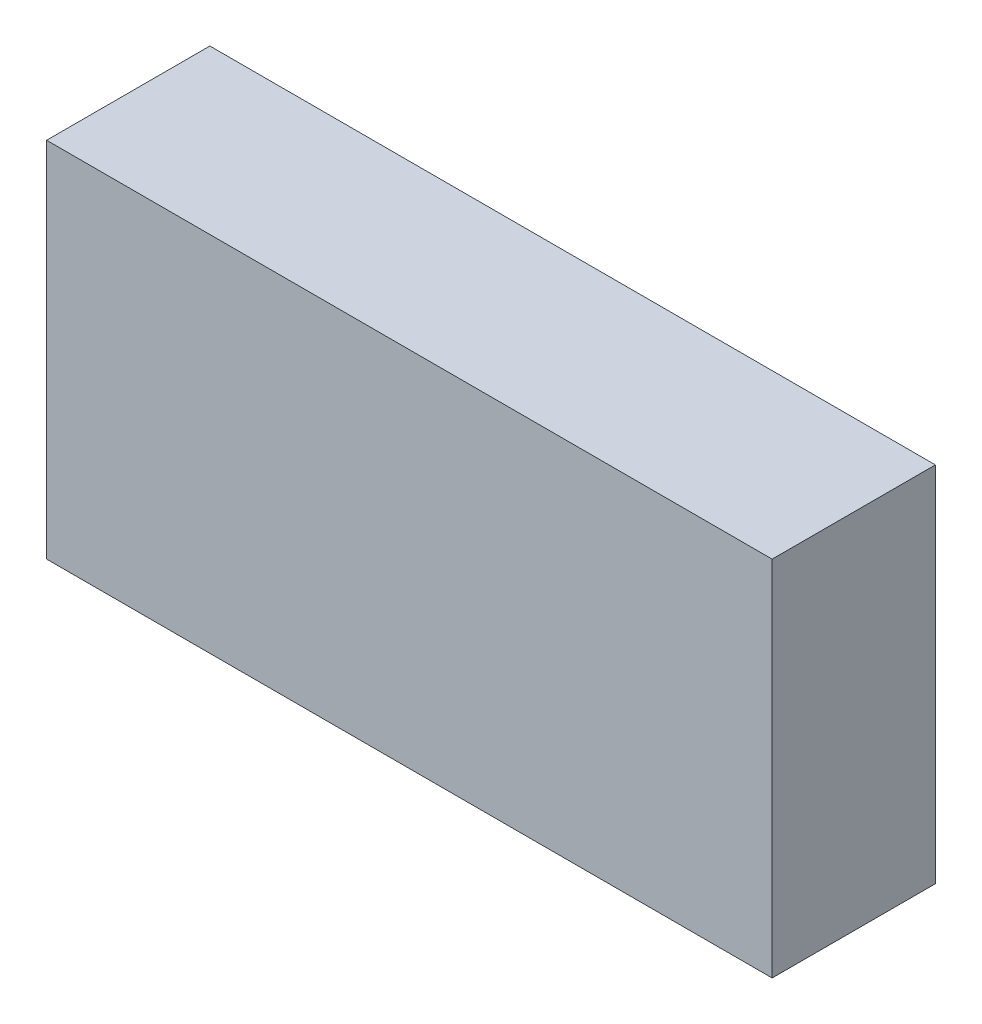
ISO-10303-21;
HEADER;
FILE_DESCRIPTION(('STEP AP214'),'2;1');
FILE_NAME('part.step','',(''),(''),'','','');
FILE_SCHEMA(('AUTOMOTIVE_DESIGN { 1 0 10303 214 1 1 1 1 }'));
ENDSEC;
DATA;
#1=APPLICATION_CONTEXT('core data for automotive mechanical design processes');
#2=APPLICATION_PROTOCOL_DEFINITION('international standard','automotive_design',2000,#1);
#3=PRODUCT_CONTEXT('',#1,'mechanical');
#4=PRODUCT('Part','Part','',(#3));
#5=PRODUCT_RELATED_PRODUCT_CATEGORY('part','',(#4));
#6=PRODUCT_DEFINITION_FORMATION('','',#4);
#7=PRODUCT_DEFINITION_CONTEXT('part definition',#1,'design');
#8=PRODUCT_DEFINITION('design','',#6,#7);
#9=PRODUCT_DEFINITION_SHAPE('','',#8);
#10=(LENGTH_UNIT() NAMED_UNIT(*) SI_UNIT(.MILLI.,.METRE.));
#11=(NAMED_UNIT(*) PLANE_ANGLE_UNIT() SI_UNIT($,.RADIAN.));
#12=(NAMED_UNIT(*) SI_UNIT($,.STERADIAN.) SOLID_ANGLE_UNIT());
#13=UNCERTAINTY_MEASURE_WITH_UNIT(LENGTH_MEASURE(1.E-05),#10,'distance_accuracy_value','');
#14=(GEOMETRIC_REPRESENTATION_CONTEXT(3) GLOBAL_UNCERTAINTY_ASSIGNED_CONTEXT((#13)) GLOBAL_UNIT_ASSIGNED_CONTEXT((#10,
#11,#12)) REPRESENTATION_CONTEXT('',''));
#15=CARTESIAN_POINT('',(0.,0.,0.));
#16=DIRECTION('',(0.,0.,1.));
#17=DIRECTION('',(1.,0.,0.));
#18=AXIS2_PLACEMENT_3D('',#15,#16,#17);
#19=CARTESIAN_POINT('',(0.,0.,27.));
#20=DIRECTION('',(1.,0.,0.));
#21=DIRECTION('',(0.,1.,0.));
#22=AXIS2_PLACEMENT_3D('',#19,#20,#21);
#23=PLANE('',#22);
#24=DIRECTION('',(0.,-1.,0.));
#25=VECTOR('',#24,1.);
#26=CARTESIAN_POINT('',(0.,0.,0.));
#27=LINE('',#26,#25);
#28=CARTESIAN_POINT('',(0.,0.,0.));
#29=VERTEX_POINT('',#28);
#30=CARTESIAN_POINT('',(0.,-60.,0.));
#31=VERTEX_POINT('',#30);
#32=EDGE_CURVE('E392',#29,#31,#27,.T.);
#33=ORIENTED_EDGE('',*,*,#32,.T.);
#34=DIRECTION('',(0.,0.,-1.));
#35=VECTOR('',#34,1.);
#36=CARTESIAN_POINT('',(0.,-60.,27.));
#37=LINE('',#36,#35);
#38=CARTESIAN_POINT('',(0.,-60.,27.));
#39=VERTEX_POINT('',#38);
#40=EDGE_CURVE('E11',#39,#31,#37,.T.);
#41=ORIENTED_EDGE('',*,*,#40,.F.);
#42=DIRECTION('',(0.,-1.,0.));
#43=VECTOR('',#42,1.);
#44=CARTESIAN_POINT('',(0.,0.,27.));
#45=LINE('',#44,#43);
#46=CARTESIAN_POINT('',(0.,0.,27.));
#47=VERTEX_POINT('',#46);
#48=EDGE_CURVE('E410',#47,#39,#45,.T.);
#49=ORIENTED_EDGE('',*,*,#48,.F.);
#50=DIRECTION('',(0.,0.,-1.));
#51=VECTOR('',#50,1.);
#52=CARTESIAN_POINT('',(0.,0.,27.));
#53=LINE('',#52,#51);
#54=EDGE_CURVE('E404',#47,#29,#53,.T.);
#55=ORIENTED_EDGE('',*,*,#54,.T.);
#56=EDGE_LOOP('',(#33,#41,#49,#55));
#57=FACE_BOUND('',#56,.T.);
#58=ADVANCED_FACE('F348',(#57),#23,.F.);
#59=CARTESIAN_POINT('',(0.,-60.,27.));
#60=DIRECTION('',(0.,1.,0.));
#61=DIRECTION('',(0.,0.,1.));
#62=AXIS2_PLACEMENT_3D('',#59,#60,#61);
#63=PLANE('',#62);
#64=DIRECTION('',(1.,0.,0.));
#65=VECTOR('',#64,1.);
#66=CARTESIAN_POINT('',(0.,-60.,0.));
#67=LINE('',#66,#65);
#68=CARTESIAN_POINT('',(120.,-60.,0.));
#69=VERTEX_POINT('',#68);
#70=EDGE_CURVE('E388',#31,#69,#67,.T.);
#71=ORIENTED_EDGE('',*,*,#70,.T.);
#72=DIRECTION('',(0.,0.,-1.));
#73=VECTOR('',#72,1.);
#74=CARTESIAN_POINT('',(120.,-60.,27.));
#75=LINE('',#74,#73);
#76=CARTESIAN_POINT('',(120.,-60.,27.));
#77=VERTEX_POINT('',#76);
#78=EDGE_CURVE('E355',#77,#69,#75,.T.);
#79=ORIENTED_EDGE('',*,*,#78,.F.);
#80=DIRECTION('',(1.,0.,0.));
#81=VECTOR('',#80,1.);
#82=CARTESIAN_POINT('',(0.,-60.,27.));
#83=LINE('',#82,#81);
#84=EDGE_CURVE('E400',#39,#77,#83,.T.);
#85=ORIENTED_EDGE('',*,*,#84,.F.);
#86=ORIENTED_EDGE('',*,*,#40,.T.);
#87=EDGE_LOOP('',(#71,#79,#85,#86));
#88=FACE_BOUND('',#87,.T.);
#89=ADVANCED_FACE('F399',(#88),#63,.F.);
#90=CARTESIAN_POINT('',(120.,0.,27.));
#91=DIRECTION('',(-1.,0.,0.));
#92=DIRECTION('',(0.,-1.,0.));
#93=AXIS2_PLACEMENT_3D('',#90,#91,#92);
#94=PLANE('',#93);
#95=DIRECTION('',(0.,1.,0.));
#96=VECTOR('',#95,1.);
#97=CARTESIAN_POINT('',(120.,0.,0.));
#98=LINE('',#97,#96);
#99=CARTESIAN_POINT('',(120.,0.,0.));
#100=VERTEX_POINT('',#99);
#101=EDGE_CURVE('E393',#69,#100,#98,.T.);
#102=ORIENTED_EDGE('',*,*,#101,.T.);
#103=DIRECTION('',(0.,0.,-1.));
#104=VECTOR('',#103,1.);
#105=CARTESIAN_POINT('',(120.,0.,27.));
#106=LINE('',#105,#104);
#107=CARTESIAN_POINT('',(120.,0.,27.));
#108=VERTEX_POINT('',#107);
#109=EDGE_CURVE('E416',#108,#100,#106,.T.);
#110=ORIENTED_EDGE('',*,*,#109,.F.);
#111=DIRECTION('',(0.,1.,0.));
#112=VECTOR('',#111,1.);
#113=CARTESIAN_POINT('',(120.,0.,27.));
#114=LINE('',#113,#112);
#115=EDGE_CURVE('E367',#77,#108,#114,.T.);
#116=ORIENTED_EDGE('',*,*,#115,.F.);
#117=ORIENTED_EDGE('',*,*,#78,.T.);
#118=EDGE_LOOP('',(#102,#110,#116,#117));
#119=FACE_BOUND('',#118,.T.);
#120=ADVANCED_FACE('F419',(#119),#94,.F.);
#121=CARTESIAN_POINT('',(0.,0.,27.));
#122=DIRECTION('',(0.,-1.,0.));
#123=DIRECTION('',(0.,0.,-1.));
#124=AXIS2_PLACEMENT_3D('',#121,#122,#123);
#125=PLANE('',#124);
#126=DIRECTION('',(-1.,0.,0.));
#127=VECTOR('',#126,1.);
#128=CARTESIAN_POINT('',(0.,0.,0.));
#129=LINE('',#128,#127);
#130=EDGE_CURVE('E408',#100,#29,#129,.T.);
#131=ORIENTED_EDGE('',*,*,#130,.T.);
#132=ORIENTED_EDGE('',*,*,#54,.F.);
#133=DIRECTION('',(-1.,0.,0.));
#134=VECTOR('',#133,1.);
#135=CARTESIAN_POINT('',(0.,0.,27.));
#136=LINE('',#135,#134);
#137=EDGE_CURVE('E362',#108,#47,#136,.T.);
#138=ORIENTED_EDGE('',*,*,#137,.F.);
#139=ORIENTED_EDGE('',*,*,#109,.T.);
#140=EDGE_LOOP('',(#131,#132,#138,#139));
#141=FACE_BOUND('',#140,.T.);
#142=ADVANCED_FACE('F421',(#141),#125,.F.);
#143=CARTESIAN_POINT('',(0.,-60.,27.));
#144=DIRECTION('',(0.,0.,1.));
#145=DIRECTION('',(1.,0.,0.));
#146=AXIS2_PLACEMENT_3D('',#143,#144,#145);
#147=PLANE('',#146);
#148=ORIENTED_EDGE('',*,*,#48,.T.);
#149=ORIENTED_EDGE('',*,*,#84,.T.);
#150=ORIENTED_EDGE('',*,*,#115,.T.);
#151=ORIENTED_EDGE('',*,*,#137,.T.);
#152=EDGE_LOOP('',(#148,#149,#150,#151));
#153=FACE_BOUND('',#152,.T.);
#154=ADVANCED_FACE('F422',(#153),#147,.T.);
#155=CARTESIAN_POINT('',(0.,-60.,0.));
#156=DIRECTION('',(0.,0.,1.));
#157=DIRECTION('',(1.,0.,0.));
#158=AXIS2_PLACEMENT_3D('',#155,#156,#157);
#159=PLANE('',#158);
#160=ORIENTED_EDGE('',*,*,#32,.F.);
#161=ORIENTED_EDGE('',*,*,#130,.F.);
#162=ORIENTED_EDGE('',*,*,#101,.F.);
#163=ORIENTED_EDGE('',*,*,#70,.F.);
#164=EDGE_LOOP('',(#160,#161,#162,#163));
#165=FACE_BOUND('',#164,.T.);
#166=ADVANCED_FACE('F389',(#165),#159,.F.);
#167=CLOSED_SHELL('',(#58,#89,#120,#142,#154,#166));
#168=MANIFOLD_SOLID_BREP('B2',#167);
#169=ADVANCED_BREP_SHAPE_REPRESENTATION('',(#18,#168),#14);
#170=SHAPE_DEFINITION_REPRESENTATION(#9,#169);
ENDSEC;
END-ISO-10303-21;
